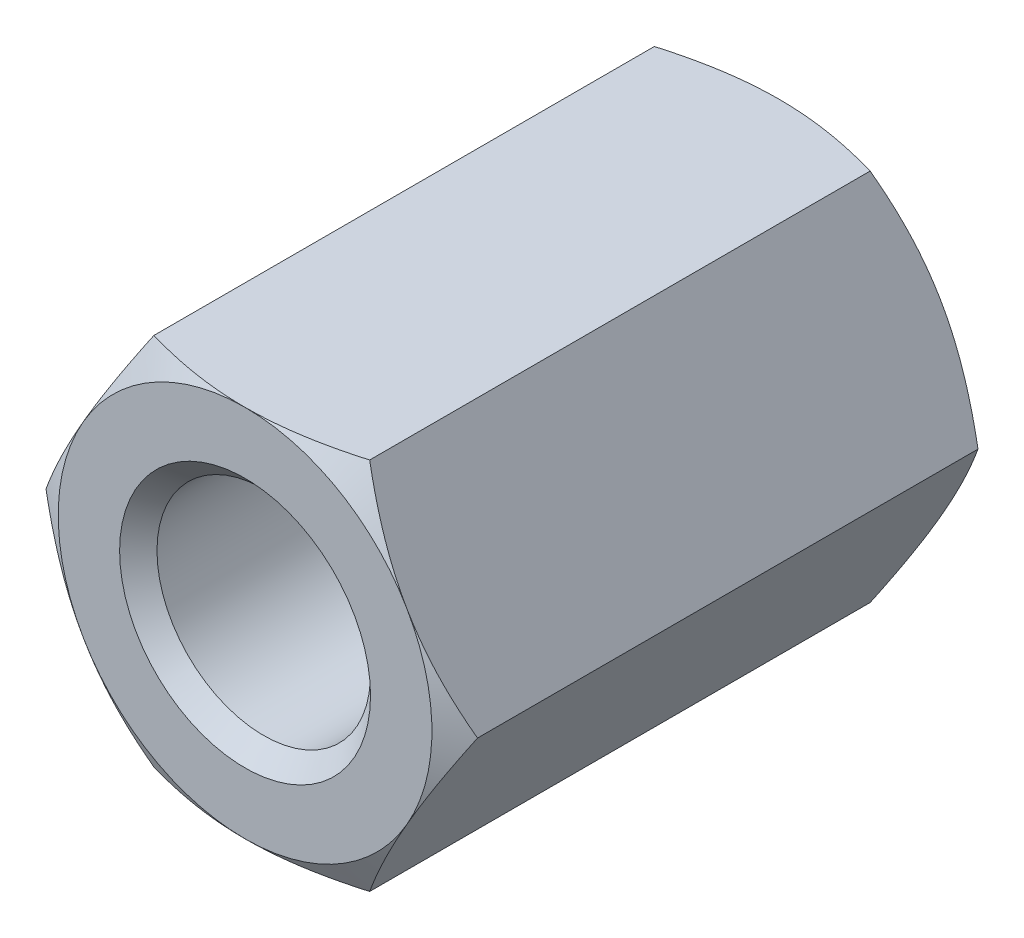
ISO-10303-21;
HEADER;
FILE_DESCRIPTION(('STEP AP214'),'2;1');
FILE_NAME('part.step','',(''),(''),'','','');
FILE_SCHEMA(('AUTOMOTIVE_DESIGN { 1 0 10303 214 1 1 1 1 }'));
ENDSEC;
DATA;
#1=APPLICATION_CONTEXT('core data for automotive mechanical design processes');
#2=APPLICATION_PROTOCOL_DEFINITION('international standard','automotive_design',2000,#1);
#3=PRODUCT_CONTEXT('',#1,'mechanical');
#4=PRODUCT('Part','Part','',(#3));
#5=PRODUCT_RELATED_PRODUCT_CATEGORY('part','',(#4));
#6=PRODUCT_DEFINITION_FORMATION('','',#4);
#7=PRODUCT_DEFINITION_CONTEXT('part definition',#1,'design');
#8=PRODUCT_DEFINITION('design','',#6,#7);
#9=PRODUCT_DEFINITION_SHAPE('','',#8);
#10=(LENGTH_UNIT() NAMED_UNIT(*) SI_UNIT(.MILLI.,.METRE.));
#11=(NAMED_UNIT(*) PLANE_ANGLE_UNIT() SI_UNIT($,.RADIAN.));
#12=(NAMED_UNIT(*) SI_UNIT($,.STERADIAN.) SOLID_ANGLE_UNIT());
#13=UNCERTAINTY_MEASURE_WITH_UNIT(LENGTH_MEASURE(1.E-05),#10,'distance_accuracy_value','');
#14=(GEOMETRIC_REPRESENTATION_CONTEXT(3) GLOBAL_UNCERTAINTY_ASSIGNED_CONTEXT((#13)) GLOBAL_UNIT_ASSIGNED_CONTEXT((#10,
#11,#12)) REPRESENTATION_CONTEXT('',''));
#15=CARTESIAN_POINT('',(0.,0.,0.));
#16=DIRECTION('',(0.,0.,1.));
#17=DIRECTION('',(1.,0.,0.));
#18=AXIS2_PLACEMENT_3D('',#15,#16,#17);
#19=CARTESIAN_POINT('',(4.04145188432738,0.,-5.));
#20=DIRECTION('',(0.866025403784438,0.5,0.));
#21=DIRECTION('',(-0.5,0.866025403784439,0.));
#22=AXIS2_PLACEMENT_3D('',#19,#20,#21);
#23=PLANE('',#22);
#24=CARTESIAN_POINT('',(4.04156735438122,-0.00019999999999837,4.68732593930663));
#25=CARTESIAN_POINT('',(3.9527667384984,0.153607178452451,4.73861421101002));
#26=CARTESIAN_POINT('',(3.86319960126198,0.308742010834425,4.7852590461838));
#27=CARTESIAN_POINT('',(3.68251437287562,0.621698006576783,4.86667812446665));
#28=CARTESIAN_POINT('',(3.59139307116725,0.779524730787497,4.90142356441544));
#29=CARTESIAN_POINT('',(3.41027974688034,1.09322221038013,4.95550997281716));
#30=CARTESIAN_POINT('',(3.32031559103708,1.24904469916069,4.97521091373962));
#31=CARTESIAN_POINT('',(3.13996396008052,1.56142288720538,4.99872986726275));
#32=CARTESIAN_POINT('',(3.04957714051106,1.71797745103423,5.00256735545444));
#33=CARTESIAN_POINT('',(2.88068384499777,2.01050921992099,4.99458469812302));
#34=CARTESIAN_POINT('',(2.80215208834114,2.14653021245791,4.98472456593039));
#35=CARTESIAN_POINT('',(2.64560020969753,2.417686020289,4.9534735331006));
#36=CARTESIAN_POINT('',(2.5675806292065,2.55281989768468,4.9320719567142));
#37=CARTESIAN_POINT('',(2.41070596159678,2.82453479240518,4.87856959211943));
#38=CARTESIAN_POINT('',(2.33187072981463,2.96108141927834,4.84624200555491));
#39=CARTESIAN_POINT('',(2.17537608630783,3.2321380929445,4.77287106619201));
#40=CARTESIAN_POINT('',(2.09771466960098,3.36665161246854,4.73184495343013));
#41=CARTESIAN_POINT('',(2.02061047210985,3.5002,4.68732593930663));
#42=B_SPLINE_CURVE_WITH_KNOTS('',3,(#24,#25,#26,#27,#28,#29,#30,#31,#32,#33,#34,#35,#36,#37,#38,
#39,#40,#41),.UNSPECIFIED.,.F.,.F.,(4,2,2,2,2,2,2,2,4),(0.,0.554793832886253,1.11092123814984,
1.65328467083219,2.19498204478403,2.6666513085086,3.13875761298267,3.6213361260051,
4.10296698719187),.UNSPECIFIED.);
#43=CARTESIAN_POINT('',(4.04145188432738,0.,4.68739260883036));
#44=VERTEX_POINT('',#43);
#45=CARTESIAN_POINT('',(3.03108891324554,1.75,5.));
#46=VERTEX_POINT('',#45);
#47=EDGE_CURVE('E127',#44,#46,#42,.T.);
#48=ORIENTED_EDGE('',*,*,#47,.F.);
#49=DIRECTION('',(0.,0.,1.));
#50=VECTOR('',#49,1.);
#51=CARTESIAN_POINT('',(4.04145188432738,0.,-5.));
#52=LINE('',#51,#50);
#53=CARTESIAN_POINT('',(4.04145188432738,0.,-4.68739260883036));
#54=VERTEX_POINT('',#53);
#55=EDGE_CURVE('E526',#54,#44,#52,.T.);
#56=ORIENTED_EDGE('',*,*,#55,.F.);
#57=CARTESIAN_POINT('',(4.04156735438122,-0.00019999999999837,-4.68732593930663));
#58=CARTESIAN_POINT('',(3.9527667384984,0.153607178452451,-4.73861421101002));
#59=CARTESIAN_POINT('',(3.86319960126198,0.308742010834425,-4.7852590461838));
#60=CARTESIAN_POINT('',(3.68251437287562,0.621698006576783,-4.86667812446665));
#61=CARTESIAN_POINT('',(3.59139307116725,0.779524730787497,-4.90142356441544));
#62=CARTESIAN_POINT('',(3.41027974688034,1.09322221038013,-4.95550997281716));
#63=CARTESIAN_POINT('',(3.32031559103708,1.24904469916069,-4.97521091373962));
#64=CARTESIAN_POINT('',(3.13996396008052,1.56142288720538,-4.99872986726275));
#65=CARTESIAN_POINT('',(3.04957714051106,1.71797745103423,-5.00256735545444));
#66=CARTESIAN_POINT('',(2.88068384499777,2.01050921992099,-4.99458469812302));
#67=CARTESIAN_POINT('',(2.80215208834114,2.14653021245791,-4.98472456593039));
#68=CARTESIAN_POINT('',(2.64560020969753,2.417686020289,-4.9534735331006));
#69=CARTESIAN_POINT('',(2.5675806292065,2.55281989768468,-4.9320719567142));
#70=CARTESIAN_POINT('',(2.41070596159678,2.82453479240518,-4.87856959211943));
#71=CARTESIAN_POINT('',(2.33187072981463,2.96108141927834,-4.84624200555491));
#72=CARTESIAN_POINT('',(2.17537608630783,3.2321380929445,-4.77287106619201));
#73=CARTESIAN_POINT('',(2.09771466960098,3.36665161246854,-4.73184495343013));
#74=CARTESIAN_POINT('',(2.02061047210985,3.5002,-4.68732593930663));
#75=B_SPLINE_CURVE_WITH_KNOTS('',3,(#57,#58,#59,#60,#61,#62,#63,#64,#65,#66,#67,#68,#69,#70,#71,
#72,#73,#74),.UNSPECIFIED.,.F.,.F.,(4,2,2,2,2,2,2,2,4),(0.,0.554793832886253,1.11092123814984,
1.65328467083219,2.19498204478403,2.6666513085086,3.13875761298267,3.6213361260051,
4.10296698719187),.UNSPECIFIED.);
#76=CARTESIAN_POINT('',(3.03108891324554,1.75,-5.));
#77=VERTEX_POINT('',#76);
#78=EDGE_CURVE('E618',#54,#77,#75,.T.);
#79=ORIENTED_EDGE('',*,*,#78,.T.);
#80=CARTESIAN_POINT('',(2.02072594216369,3.5,-4.68739260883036));
#81=VERTEX_POINT('',#80);
#82=EDGE_CURVE('E268',#77,#81,#75,.T.);
#83=ORIENTED_EDGE('',*,*,#82,.T.);
#84=DIRECTION('',(0.,0.,1.));
#85=VECTOR('',#84,1.);
#86=CARTESIAN_POINT('',(2.02072594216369,3.5,-5.));
#87=LINE('',#86,#85);
#88=CARTESIAN_POINT('',(2.0207259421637,3.5,4.68739260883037));
#89=VERTEX_POINT('',#88);
#90=EDGE_CURVE('E159',#81,#89,#87,.T.);
#91=ORIENTED_EDGE('',*,*,#90,.T.);
#92=EDGE_CURVE('E140',#46,#89,#42,.T.);
#93=ORIENTED_EDGE('',*,*,#92,.F.);
#94=EDGE_LOOP('',(#48,#56,#79,#83,#91,#93));
#95=FACE_BOUND('',#94,.T.);
#96=ADVANCED_FACE('F41',(#95),#23,.T.);
#97=CARTESIAN_POINT('',(2.02072594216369,-3.5,-5.));
#98=DIRECTION('',(0.866025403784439,-0.5,0.));
#99=DIRECTION('',(0.5,0.866025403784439,0.));
#100=AXIS2_PLACEMENT_3D('',#97,#98,#99);
#101=PLANE('',#100);
#102=CARTESIAN_POINT('',(2.02061047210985,-3.5002,4.68732593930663));
#103=CARTESIAN_POINT('',(2.10941108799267,-3.34639282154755,4.73861421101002));
#104=CARTESIAN_POINT('',(2.19897822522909,-3.19125798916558,4.7852590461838));
#105=CARTESIAN_POINT('',(2.37966345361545,-2.87830199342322,4.86667812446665));
#106=CARTESIAN_POINT('',(2.47078475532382,-2.7204752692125,4.90142356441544));
#107=CARTESIAN_POINT('',(2.65189807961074,-2.40677778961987,4.95550997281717));
#108=CARTESIAN_POINT('',(2.74186223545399,-2.25095530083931,4.97521091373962));
#109=CARTESIAN_POINT('',(2.92221386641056,-1.93857711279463,4.99872986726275));
#110=CARTESIAN_POINT('',(3.01260068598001,-1.78202254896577,5.00256735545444));
#111=CARTESIAN_POINT('',(3.1814939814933,-1.48949078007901,4.99458469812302));
#112=CARTESIAN_POINT('',(3.26002573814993,-1.35346978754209,4.98472456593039));
#113=CARTESIAN_POINT('',(3.41657761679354,-1.082313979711,4.9534735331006));
#114=CARTESIAN_POINT('',(3.49459719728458,-0.947180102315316,4.9320719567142));
#115=CARTESIAN_POINT('',(3.65147186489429,-0.675465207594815,4.87856959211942));
#116=CARTESIAN_POINT('',(3.73030709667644,-0.538918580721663,4.84624200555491));
#117=CARTESIAN_POINT('',(3.88680174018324,-0.267861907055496,4.77287106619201));
#118=CARTESIAN_POINT('',(3.96446315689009,-0.133348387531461,4.73184495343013));
#119=CARTESIAN_POINT('',(4.04156735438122,0.000200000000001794,4.68732593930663));
#120=B_SPLINE_CURVE_WITH_KNOTS('',3,(#102,#103,#104,#105,#106,#107,#108,#109,#110,#111,#112,
#113,#114,#115,#116,#117,#118,#119),.UNSPECIFIED.,.F.,.F.,(4,2,2,2,2,2,2,2,4),(0.,
0.554793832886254,1.11092123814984,1.65328467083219,2.19498204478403,2.6666513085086,
3.13875761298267,3.6213361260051,4.10296698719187),.UNSPECIFIED.);
#121=CARTESIAN_POINT('',(2.02072594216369,-3.5,4.68739260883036));
#122=VERTEX_POINT('',#121);
#123=CARTESIAN_POINT('',(3.03108891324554,-1.75,5.));
#124=VERTEX_POINT('',#123);
#125=EDGE_CURVE('E559',#122,#124,#120,.T.);
#126=ORIENTED_EDGE('',*,*,#125,.F.);
#127=DIRECTION('',(0.,0.,1.));
#128=VECTOR('',#127,1.);
#129=CARTESIAN_POINT('',(2.02072594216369,-3.5,-5.));
#130=LINE('',#129,#128);
#131=CARTESIAN_POINT('',(2.02072594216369,-3.5,-4.68739260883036));
#132=VERTEX_POINT('',#131);
#133=EDGE_CURVE('E282',#132,#122,#130,.T.);
#134=ORIENTED_EDGE('',*,*,#133,.F.);
#135=CARTESIAN_POINT('',(2.02061047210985,-3.5002,-4.68732593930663));
#136=CARTESIAN_POINT('',(2.10941108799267,-3.34639282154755,-4.73861421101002));
#137=CARTESIAN_POINT('',(2.19897822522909,-3.19125798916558,-4.7852590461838));
#138=CARTESIAN_POINT('',(2.37966345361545,-2.87830199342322,-4.86667812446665));
#139=CARTESIAN_POINT('',(2.47078475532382,-2.7204752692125,-4.90142356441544));
#140=CARTESIAN_POINT('',(2.65189807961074,-2.40677778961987,-4.95550997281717));
#141=CARTESIAN_POINT('',(2.74186223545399,-2.25095530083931,-4.97521091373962));
#142=CARTESIAN_POINT('',(2.92221386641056,-1.93857711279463,-4.99872986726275));
#143=CARTESIAN_POINT('',(3.01260068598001,-1.78202254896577,-5.00256735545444));
#144=CARTESIAN_POINT('',(3.1814939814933,-1.48949078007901,-4.99458469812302));
#145=CARTESIAN_POINT('',(3.26002573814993,-1.35346978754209,-4.98472456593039));
#146=CARTESIAN_POINT('',(3.41657761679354,-1.082313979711,-4.9534735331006));
#147=CARTESIAN_POINT('',(3.49459719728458,-0.947180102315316,-4.9320719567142));
#148=CARTESIAN_POINT('',(3.65147186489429,-0.675465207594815,-4.87856959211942));
#149=CARTESIAN_POINT('',(3.73030709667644,-0.538918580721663,-4.84624200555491));
#150=CARTESIAN_POINT('',(3.88680174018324,-0.267861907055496,-4.77287106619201));
#151=CARTESIAN_POINT('',(3.96446315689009,-0.133348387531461,-4.73184495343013));
#152=CARTESIAN_POINT('',(4.04156735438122,0.000200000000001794,-4.68732593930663));
#153=B_SPLINE_CURVE_WITH_KNOTS('',3,(#135,#136,#137,#138,#139,#140,#141,#142,#143,#144,#145,
#146,#147,#148,#149,#150,#151,#152),.UNSPECIFIED.,.F.,.F.,(4,2,2,2,2,2,2,2,4),(0.,
0.554793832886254,1.11092123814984,1.65328467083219,2.19498204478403,2.6666513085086,
3.13875761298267,3.6213361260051,4.10296698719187),.UNSPECIFIED.);
#154=CARTESIAN_POINT('',(3.03108891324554,-1.75,-5.));
#155=VERTEX_POINT('',#154);
#156=EDGE_CURVE('E588',#132,#155,#153,.T.);
#157=ORIENTED_EDGE('',*,*,#156,.T.);
#158=EDGE_CURVE('E283',#155,#54,#153,.T.);
#159=ORIENTED_EDGE('',*,*,#158,.T.);
#160=ORIENTED_EDGE('',*,*,#55,.T.);
#161=EDGE_CURVE('E132',#124,#44,#120,.T.);
#162=ORIENTED_EDGE('',*,*,#161,.F.);
#163=EDGE_LOOP('',(#126,#134,#157,#159,#160,#162));
#164=FACE_BOUND('',#163,.T.);
#165=ADVANCED_FACE('F253',(#164),#101,.T.);
#166=CARTESIAN_POINT('',(-2.02072594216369,-3.5,-5.));
#167=DIRECTION('',(0.,-1.,0.));
#168=DIRECTION('',(1.,0.,0.));
#169=AXIS2_PLACEMENT_3D('',#166,#167,#168);
#170=PLANE('',#169);
#171=CARTESIAN_POINT('',(-10.7507738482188,-3.5,0.493114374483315));
#172=CARTESIAN_POINT('',(-10.5126698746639,-3.5,0.623821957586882));
#173=CARTESIAN_POINT('',(-10.2743971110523,-3.5,0.754223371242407));
#174=CARTESIAN_POINT('',(-9.79742424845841,-3.5,1.0142498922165));
#175=CARTESIAN_POINT('',(-9.55872414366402,-3.5,1.1438749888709));
#176=CARTESIAN_POINT('',(-9.08067833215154,-3.5,1.40225430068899));
#177=CARTESIAN_POINT('',(-8.84133233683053,-3.5,1.53100798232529));
#178=CARTESIAN_POINT('',(-8.36201160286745,-3.5,1.78733734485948));
#179=CARTESIAN_POINT('',(-8.12203686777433,-3.5,1.9149130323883));
#180=CARTESIAN_POINT('',(-7.6360811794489,-3.5,2.17133452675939));
#181=CARTESIAN_POINT('',(-7.39008299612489,-3.5,2.30014772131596));
#182=CARTESIAN_POINT('',(-6.89704804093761,-3.5,2.55577000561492));
#183=CARTESIAN_POINT('',(-6.65001127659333,-3.5,2.68257910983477));
#184=CARTESIAN_POINT('',(-6.15465612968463,-3.5,2.93352397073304));
#185=CARTESIAN_POINT('',(-5.90633807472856,-3.5,3.05766037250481));
#186=CARTESIAN_POINT('',(-5.40795190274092,-3.5,3.30236027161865));
#187=CARTESIAN_POINT('',(-5.15788384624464,-3.5,3.42292389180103));
#188=CARTESIAN_POINT('',(-4.64929297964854,-3.5,3.66197947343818));
#189=CARTESIAN_POINT('',(-4.39071255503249,-3.5,3.78034953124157));
#190=CARTESIAN_POINT('',(-3.87015745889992,-3.5,4.00964989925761));
#191=CARTESIAN_POINT('',(-3.60818190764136,-3.5,4.12057823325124));
#192=CARTESIAN_POINT('',(-3.08089609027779,-3.5,4.33088961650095));
#193=CARTESIAN_POINT('',(-2.81560515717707,-3.5,4.43032054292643));
#194=CARTESIAN_POINT('',(-2.27929281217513,-3.5,4.61253202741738));
#195=CARTESIAN_POINT('',(-2.00827391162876,-3.5,4.69531972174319));
#196=CARTESIAN_POINT('',(-1.54282289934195,-3.5,4.81459034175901));
#197=CARTESIAN_POINT('',(-1.35006631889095,-3.5,4.85750298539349));
#198=CARTESIAN_POINT('',(-0.961730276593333,-3.5,4.92780027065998));
#199=CARTESIAN_POINT('',(-0.766151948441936,-3.5,4.95519097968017));
#200=CARTESIAN_POINT('',(-0.374300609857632,-3.5,4.99152322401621));
#201=CARTESIAN_POINT('',(-0.178037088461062,-3.5,5.00056381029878));
#202=CARTESIAN_POINT('',(0.214451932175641,-3.5,4.99938150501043));
#203=CARTESIAN_POINT('',(0.410677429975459,-3.5,4.98915798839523));
#204=CARTESIAN_POINT('',(0.733992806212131,-3.5,4.9573376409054));
#205=CARTESIAN_POINT('',(0.861622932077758,-3.5,4.94086914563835));
#206=CARTESIAN_POINT('',(1.1157982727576,-3.5,4.90097185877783));
#207=CARTESIAN_POINT('',(1.24234333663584,-3.5,4.87754211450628));
#208=CARTESIAN_POINT('',(1.62024456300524,-3.5,4.79811364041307));
#209=CARTESIAN_POINT('',(1.86969580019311,-3.5,4.73299473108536));
#210=CARTESIAN_POINT('',(2.24231826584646,-3.5,4.62166992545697));
#211=CARTESIAN_POINT('',(2.36750184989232,-3.5,4.58182091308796));
#212=CARTESIAN_POINT('',(2.61663244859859,-3.5,4.49839474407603));
#213=CARTESIAN_POINT('',(2.74057945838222,-3.5,4.4548175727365));
#214=CARTESIAN_POINT('',(2.98728700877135,-3.5,4.36461508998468));
#215=CARTESIAN_POINT('',(3.1100480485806,-3.5,4.31799113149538));
#216=CARTESIAN_POINT('',(3.35457324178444,-3.5,4.2222085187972));
#217=CARTESIAN_POINT('',(3.47633740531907,-3.5,4.1730498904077));
#218=CARTESIAN_POINT('',(3.75851776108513,-3.5,4.05627784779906));
#219=CARTESIAN_POINT('',(3.91860417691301,-3.5,3.9878691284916));
#220=CARTESIAN_POINT('',(4.23750900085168,-3.5,3.84815013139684));
#221=CARTESIAN_POINT('',(4.39632734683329,-3.5,3.77683971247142));
#222=CARTESIAN_POINT('',(4.71293162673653,-3.5,3.63190033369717));
#223=CARTESIAN_POINT('',(4.87071738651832,-3.5,3.55827099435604));
#224=CARTESIAN_POINT('',(5.18540844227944,-3.5,3.40915170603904));
#225=CARTESIAN_POINT('',(5.34231372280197,-3.5,3.33366172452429));
#226=CARTESIAN_POINT('',(5.81219833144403,-3.5,3.10481067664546));
#227=CARTESIAN_POINT('',(6.12407798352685,-3.5,2.94919293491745));
#228=CARTESIAN_POINT('',(6.74576517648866,-3.5,2.6338733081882));
#229=CARTESIAN_POINT('',(7.05557265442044,-3.5,2.47417129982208));
#230=CARTESIAN_POINT('',(7.64897162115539,-3.5,2.16473651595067));
#231=CARTESIAN_POINT('',(7.9326796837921,-3.5,2.01522691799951));
#232=CARTESIAN_POINT('',(8.49912029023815,-3.5,1.71435396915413));
#233=CARTESIAN_POINT('',(8.78185280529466,-3.5,1.56299056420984));
#234=CARTESIAN_POINT('',(9.34596523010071,-3.5,1.2591656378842));
#235=CARTESIAN_POINT('',(9.62734673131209,-3.5,1.10670706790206));
#236=CARTESIAN_POINT('',(10.1894867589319,-3.5,0.800675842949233));
#237=CARTESIAN_POINT('',(10.4702453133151,-3.5,0.64710323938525));
#238=CARTESIAN_POINT('',(10.7507738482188,-3.5,0.493114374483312));
#239=B_SPLINE_CURVE_WITH_KNOTS('',3,(#171,#172,#173,#174,#175,#176,#177,#178,#179,#180,#181,
#182,#183,#184,#185,#186,#187,#188,#189,#190,#191,#192,#193,#194,#195,#196,#197,#198,#199,#200,
#201,#202,#203,#204,#205,#206,#207,#208,#209,#210,#211,#212,#213,#214,#215,#216,#217,#218,#219,
#220,#221,#222,#223,#224,#225,#226,#227,#228,#229,#230,#231,#232,#233,#234,#235,#236,#237,#238),
.UNSPECIFIED.,.F.,.F.,(4,2,2,2,2,2,2,2,2,2,2,2,2,2,2,2,2,2,2,2,2,2,2,2,2,2,2,2,2,2,2,2,2,4),(0.,
0.814863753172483,1.62973867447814,2.44507408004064,3.26040489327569,4.09344743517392,
4.92648395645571,5.75931710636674,6.59212158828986,7.44520212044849,8.2985083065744,
9.14812242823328,9.99737147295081,10.5893043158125,11.1810056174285,11.7695044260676,
12.3580223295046,12.7438949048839,13.1298203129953,13.9021847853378,14.2962763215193,
14.6903694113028,15.0842886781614,15.478203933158,16.0004361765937,16.5226938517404,
17.0450374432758,17.5673901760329,18.6129831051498,19.6586076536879,20.6206746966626,
21.5827698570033,22.5428569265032,23.5028999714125),.UNSPECIFIED.);
#240=CARTESIAN_POINT('',(-2.02072594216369,-3.5,4.68739260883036));
#241=VERTEX_POINT('',#240);
#242=CARTESIAN_POINT('',(0.,-3.5,5.));
#243=VERTEX_POINT('',#242);
#244=EDGE_CURVE('E552',#241,#243,#239,.T.);
#245=ORIENTED_EDGE('',*,*,#244,.F.);
#246=DIRECTION('',(0.,0.,1.));
#247=VECTOR('',#246,1.);
#248=CARTESIAN_POINT('',(-2.02072594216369,-3.5,-5.));
#249=LINE('',#248,#247);
#250=CARTESIAN_POINT('',(-2.02072594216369,-3.5,-4.68739260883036));
#251=VERTEX_POINT('',#250);
#252=EDGE_CURVE('E577',#251,#241,#249,.T.);
#253=ORIENTED_EDGE('',*,*,#252,.F.);
#254=CARTESIAN_POINT('',(-7.9267982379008,-3.5,-2.01792238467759));
#255=CARTESIAN_POINT('',(-7.74585500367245,-3.5,-2.11347826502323));
#256=CARTESIAN_POINT('',(-7.56469853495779,-3.5,-2.20863320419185));
#257=CARTESIAN_POINT('',(-7.20185417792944,-3.5,-2.39793519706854));
#258=CARTESIAN_POINT('',(-7.02016627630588,-3.5,-2.49208222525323));
#259=CARTESIAN_POINT('',(-6.65593697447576,-3.5,-2.67927382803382));
#260=CARTESIAN_POINT('',(-6.47339479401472,-3.5,-2.77231688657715));
#261=CARTESIAN_POINT('',(-6.1075482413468,-3.5,-2.95689246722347));
#262=CARTESIAN_POINT('',(-5.9242438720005,-3.5,-3.04842499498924));
#263=CARTESIAN_POINT('',(-5.54664352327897,-3.5,-3.23456421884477));
#264=CARTESIAN_POINT('',(-5.35229516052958,-3.5,-3.32906489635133));
#265=CARTESIAN_POINT('',(-4.96230623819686,-3.5,-3.51537367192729));
#266=CARTESIAN_POINT('',(-4.76666566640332,-3.5,-3.60718174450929));
#267=CARTESIAN_POINT('',(-4.37385366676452,-3.5,-3.78723837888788));
#268=CARTESIAN_POINT('',(-4.17668297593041,-3.5,-3.87548854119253));
#269=CARTESIAN_POINT('',(-3.78031667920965,-3.5,-4.04730762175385));
#270=CARTESIAN_POINT('',(-3.58112119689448,-3.5,-4.13087682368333));
#271=CARTESIAN_POINT('',(-3.16157019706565,-3.5,-4.29916704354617));
#272=CARTESIAN_POINT('',(-2.94096601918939,-3.5,-4.38327567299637));
#273=CARTESIAN_POINT('',(-2.49588109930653,-3.5,-4.54090784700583));
#274=CARTESIAN_POINT('',(-2.27139918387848,-3.5,-4.61442812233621));
#275=CARTESIAN_POINT('',(-1.82231733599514,-3.5,-4.74519733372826));
#276=CARTESIAN_POINT('',(-1.59780434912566,-3.5,-4.80273452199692));
#277=CARTESIAN_POINT('',(-1.25802721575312,-3.5,-4.87429241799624));
#278=CARTESIAN_POINT('',(-1.14430805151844,-3.5,-4.89568205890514));
#279=CARTESIAN_POINT('',(-0.915972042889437,-3.5,-4.9329024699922));
#280=CARTESIAN_POINT('',(-0.801355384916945,-3.5,-4.94873436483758));
#281=CARTESIAN_POINT('',(-0.587977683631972,-3.5,-4.97244310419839));
#282=CARTESIAN_POINT('',(-0.489307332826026,-3.5,-4.98113663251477));
#283=CARTESIAN_POINT('',(-0.291673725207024,-3.5,-4.99378801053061));
#284=CARTESIAN_POINT('',(-0.192710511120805,-3.5,-4.9977465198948));
#285=CARTESIAN_POINT('',(0.00527862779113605,-3.5,-5.00080497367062));
#286=CARTESIAN_POINT('',(0.104304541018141,-3.5,-4.99990564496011));
#287=CARTESIAN_POINT('',(0.302186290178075,-3.5,-4.99328592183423));
#288=CARTESIAN_POINT('',(0.401042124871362,-3.5,-4.98756549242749));
#289=CARTESIAN_POINT('',(0.700661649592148,-3.5,-4.96309822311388));
#290=CARTESIAN_POINT('',(0.900867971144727,-3.5,-4.93699536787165));
#291=CARTESIAN_POINT('',(1.19891955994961,-3.5,-4.88544014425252));
#292=CARTESIAN_POINT('',(1.2979194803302,-3.5,-4.86618155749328));
#293=CARTESIAN_POINT('',(1.49513477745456,-3.5,-4.82398116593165));
#294=CARTESIAN_POINT('',(1.59335017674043,-3.5,-4.80103946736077));
#295=CARTESIAN_POINT('',(1.83374956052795,-3.5,-4.74065787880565));
#296=CARTESIAN_POINT('',(1.97547261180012,-3.5,-4.70138966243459));
#297=CARTESIAN_POINT('',(2.25723868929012,-3.5,-4.61721544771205));
#298=CARTESIAN_POINT('',(2.39728144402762,-3.5,-4.57230855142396));
#299=CARTESIAN_POINT('',(2.67593858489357,-3.5,-4.47789895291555));
#300=CARTESIAN_POINT('',(2.81455158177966,-3.5,-4.42839217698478));
#301=CARTESIAN_POINT('',(3.09039174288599,-3.5,-4.3257051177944));
#302=CARTESIAN_POINT('',(3.22761899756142,-3.5,-4.2725250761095));
#303=CARTESIAN_POINT('',(3.50148947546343,-3.5,-4.16295081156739));
#304=CARTESIAN_POINT('',(3.63812736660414,-3.5,-4.10654331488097));
#305=CARTESIAN_POINT('',(3.91037121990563,-3.5,-3.99128927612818));
#306=CARTESIAN_POINT('',(4.04597715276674,-3.5,-3.93244266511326));
#307=CARTESIAN_POINT('',(4.45134783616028,-3.5,-3.75299211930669));
#308=CARTESIAN_POINT('',(4.71979905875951,-3.5,-3.6294229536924));
#309=CARTESIAN_POINT('',(5.23640668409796,-3.5,-3.3852726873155));
#310=CARTESIAN_POINT('',(5.48472802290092,-3.5,-3.26503715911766));
#311=CARTESIAN_POINT('',(5.97971131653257,-3.5,-3.02112901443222));
#312=CARTESIAN_POINT('',(6.22637306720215,-3.5,-2.89745598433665));
#313=CARTESIAN_POINT('',(6.71590281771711,-3.5,-2.64885013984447));
#314=CARTESIAN_POINT('',(6.95878387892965,-3.5,-2.52394295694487));
#315=CARTESIAN_POINT('',(7.44349847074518,-3.5,-2.27222658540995));
#316=CARTESIAN_POINT('',(7.68533219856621,-3.5,-2.14541777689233));
#317=CARTESIAN_POINT('',(7.9267982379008,-3.5,-2.01792238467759));
#318=B_SPLINE_CURVE_WITH_KNOTS('',3,(#254,#255,#256,#257,#258,#259,#260,#261,#262,#263,#264,
#265,#266,#267,#268,#269,#270,#271,#272,#273,#274,#275,#276,#277,#278,#279,#280,#281,#282,#283,
#284,#285,#286,#287,#288,#289,#290,#291,#292,#293,#294,#295,#296,#297,#298,#299,#300,#301,#302,
#303,#304,#305,#306,#307,#308,#309,#310,#311,#312,#313,#314,#315,#316,#317),.UNSPECIFIED.,.F.,
.F.,(4,2,2,2,2,2,2,2,2,2,2,2,2,2,2,2,2,2,2,2,2,2,2,2,2,2,2,2,2,2,2,4),(0.,0.613876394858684,
1.22776829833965,1.84242338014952,2.45707615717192,3.10537717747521,3.75368433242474,
4.40169651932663,5.04966939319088,5.75775575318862,6.46606027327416,7.16061004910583,
7.50763711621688,7.85459391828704,8.15164543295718,8.44865555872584,8.74562124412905,
9.04258908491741,9.64730887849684,9.94982773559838,10.2523378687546,10.6933745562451,
11.1344815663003,11.5759830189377,12.0174554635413,12.4608962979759,12.9043496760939,
13.790823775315,14.6184909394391,15.4462581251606,16.2656007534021,17.0847817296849),.UNSPECIFIED.);
#319=CARTESIAN_POINT('',(0.,-3.5,-5.));
#320=VERTEX_POINT('',#319);
#321=EDGE_CURVE('E575',#251,#320,#318,.T.);
#322=ORIENTED_EDGE('',*,*,#321,.T.);
#323=EDGE_CURVE('E258',#320,#132,#318,.T.);
#324=ORIENTED_EDGE('',*,*,#323,.T.);
#325=ORIENTED_EDGE('',*,*,#133,.T.);
#326=EDGE_CURVE('E138',#243,#122,#239,.T.);
#327=ORIENTED_EDGE('',*,*,#326,.F.);
#328=EDGE_LOOP('',(#245,#253,#322,#324,#325,#327));
#329=FACE_BOUND('',#328,.T.);
#330=ADVANCED_FACE('F291',(#329),#170,.T.);
#331=CARTESIAN_POINT('',(-4.04145188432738,0.,-5.));
#332=DIRECTION('',(-0.866025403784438,-0.5,0.));
#333=DIRECTION('',(0.5,-0.866025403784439,0.));
#334=AXIS2_PLACEMENT_3D('',#331,#332,#333);
#335=PLANE('',#334);
#336=CARTESIAN_POINT('',(-4.04156735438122,0.000199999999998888,4.68732593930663));
#337=CARTESIAN_POINT('',(-3.9527667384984,-0.153607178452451,4.73861421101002));
#338=CARTESIAN_POINT('',(-3.86319960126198,-0.308742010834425,4.78525904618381));
#339=CARTESIAN_POINT('',(-3.68251437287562,-0.621698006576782,4.86667812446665));
#340=CARTESIAN_POINT('',(-3.59139307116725,-0.779524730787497,4.90142356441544));
#341=CARTESIAN_POINT('',(-3.41027974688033,-1.09322221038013,4.95550997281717));
#342=CARTESIAN_POINT('',(-3.32031559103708,-1.24904469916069,4.97521091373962));
#343=CARTESIAN_POINT('',(-3.13996396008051,-1.56142288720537,4.99872986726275));
#344=CARTESIAN_POINT('',(-3.04957714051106,-1.71797745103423,5.00256735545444));
#345=CARTESIAN_POINT('',(-2.88068384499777,-2.01050921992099,4.99458469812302));
#346=CARTESIAN_POINT('',(-2.80215208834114,-2.14653021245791,4.98472456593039));
#347=CARTESIAN_POINT('',(-2.64560020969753,-2.41768602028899,4.9534735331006));
#348=CARTESIAN_POINT('',(-2.56758062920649,-2.55281989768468,4.9320719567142));
#349=CARTESIAN_POINT('',(-2.41070596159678,-2.82453479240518,4.87856959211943));
#350=CARTESIAN_POINT('',(-2.33187072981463,-2.96108141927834,4.84624200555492));
#351=CARTESIAN_POINT('',(-2.17537608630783,-3.2321380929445,4.77287106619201));
#352=CARTESIAN_POINT('',(-2.09771466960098,-3.36665161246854,4.73184495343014));
#353=CARTESIAN_POINT('',(-2.02061047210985,-3.5002,4.68732593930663));
#354=B_SPLINE_CURVE_WITH_KNOTS('',3,(#336,#337,#338,#339,#340,#341,#342,#343,#344,#345,#346,
#347,#348,#349,#350,#351,#352,#353),.UNSPECIFIED.,.F.,.F.,(4,2,2,2,2,2,2,2,4),(0.,
0.554793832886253,1.11092123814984,1.65328467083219,2.19498204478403,2.6666513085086,
3.13875761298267,3.6213361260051,4.10296698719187),.UNSPECIFIED.);
#355=CARTESIAN_POINT('',(-4.04145188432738,0.,4.68739260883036));
#356=VERTEX_POINT('',#355);
#357=CARTESIAN_POINT('',(-3.03108891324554,-1.75,5.));
#358=VERTEX_POINT('',#357);
#359=EDGE_CURVE('E175',#356,#358,#354,.T.);
#360=ORIENTED_EDGE('',*,*,#359,.F.);
#361=DIRECTION('',(0.,0.,1.));
#362=VECTOR('',#361,1.);
#363=CARTESIAN_POINT('',(-4.04145188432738,0.,-5.));
#364=LINE('',#363,#362);
#365=CARTESIAN_POINT('',(-4.04145188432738,0.,-4.68739260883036));
#366=VERTEX_POINT('',#365);
#367=EDGE_CURVE('E581',#366,#356,#364,.T.);
#368=ORIENTED_EDGE('',*,*,#367,.F.);
#369=CARTESIAN_POINT('',(-4.04156735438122,0.000199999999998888,-4.68732593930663));
#370=CARTESIAN_POINT('',(-3.9527667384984,-0.153607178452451,-4.73861421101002));
#371=CARTESIAN_POINT('',(-3.86319960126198,-0.308742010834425,-4.78525904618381));
#372=CARTESIAN_POINT('',(-3.68251437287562,-0.621698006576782,-4.86667812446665));
#373=CARTESIAN_POINT('',(-3.59139307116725,-0.779524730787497,-4.90142356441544));
#374=CARTESIAN_POINT('',(-3.41027974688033,-1.09322221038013,-4.95550997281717));
#375=CARTESIAN_POINT('',(-3.32031559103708,-1.24904469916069,-4.97521091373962));
#376=CARTESIAN_POINT('',(-3.13996396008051,-1.56142288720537,-4.99872986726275));
#377=CARTESIAN_POINT('',(-3.04957714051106,-1.71797745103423,-5.00256735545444));
#378=CARTESIAN_POINT('',(-2.88068384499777,-2.01050921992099,-4.99458469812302));
#379=CARTESIAN_POINT('',(-2.80215208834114,-2.14653021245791,-4.98472456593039));
#380=CARTESIAN_POINT('',(-2.64560020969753,-2.41768602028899,-4.9534735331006));
#381=CARTESIAN_POINT('',(-2.56758062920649,-2.55281989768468,-4.9320719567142));
#382=CARTESIAN_POINT('',(-2.41070596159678,-2.82453479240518,-4.87856959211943));
#383=CARTESIAN_POINT('',(-2.33187072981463,-2.96108141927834,-4.84624200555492));
#384=CARTESIAN_POINT('',(-2.17537608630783,-3.2321380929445,-4.77287106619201));
#385=CARTESIAN_POINT('',(-2.09771466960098,-3.36665161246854,-4.73184495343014));
#386=CARTESIAN_POINT('',(-2.02061047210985,-3.5002,-4.68732593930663));
#387=B_SPLINE_CURVE_WITH_KNOTS('',3,(#369,#370,#371,#372,#373,#374,#375,#376,#377,#378,#379,
#380,#381,#382,#383,#384,#385,#386),.UNSPECIFIED.,.F.,.F.,(4,2,2,2,2,2,2,2,4),(0.,
0.554793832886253,1.11092123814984,1.65328467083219,2.19498204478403,2.6666513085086,
3.13875761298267,3.6213361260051,4.10296698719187),.UNSPECIFIED.);
#388=CARTESIAN_POINT('',(-3.03108891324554,-1.75,-5.));
#389=VERTEX_POINT('',#388);
#390=EDGE_CURVE('E274',#366,#389,#387,.T.);
#391=ORIENTED_EDGE('',*,*,#390,.T.);
#392=EDGE_CURVE('E281',#389,#251,#387,.T.);
#393=ORIENTED_EDGE('',*,*,#392,.T.);
#394=ORIENTED_EDGE('',*,*,#252,.T.);
#395=EDGE_CURVE('E546',#358,#241,#354,.T.);
#396=ORIENTED_EDGE('',*,*,#395,.F.);
#397=EDGE_LOOP('',(#360,#368,#391,#393,#394,#396));
#398=FACE_BOUND('',#397,.T.);
#399=ADVANCED_FACE('F288',(#398),#335,.T.);
#400=CARTESIAN_POINT('',(-2.02072594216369,3.5,-5.));
#401=DIRECTION('',(-0.866025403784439,0.5,0.));
#402=DIRECTION('',(-0.5,-0.866025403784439,0.));
#403=AXIS2_PLACEMENT_3D('',#400,#401,#402);
#404=PLANE('',#403);
#405=CARTESIAN_POINT('',(-2.02061047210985,3.5002,4.68732593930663));
#406=CARTESIAN_POINT('',(-2.10941108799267,3.34639282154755,4.73861421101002));
#407=CARTESIAN_POINT('',(-2.19897822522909,3.19125798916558,4.78525904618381));
#408=CARTESIAN_POINT('',(-2.37966345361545,2.87830199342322,4.86667812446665));
#409=CARTESIAN_POINT('',(-2.47078475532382,2.7204752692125,4.90142356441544));
#410=CARTESIAN_POINT('',(-2.65189807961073,2.40677778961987,4.95550997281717));
#411=CARTESIAN_POINT('',(-2.74186223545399,2.25095530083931,4.97521091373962));
#412=CARTESIAN_POINT('',(-2.92221386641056,1.93857711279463,4.99872986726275));
#413=CARTESIAN_POINT('',(-3.01260068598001,1.78202254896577,5.00256735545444));
#414=CARTESIAN_POINT('',(-3.1814939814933,1.48949078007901,4.99458469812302));
#415=CARTESIAN_POINT('',(-3.26002573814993,1.35346978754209,4.98472456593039));
#416=CARTESIAN_POINT('',(-3.41657761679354,1.082313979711,4.9534735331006));
#417=CARTESIAN_POINT('',(-3.49459719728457,0.947180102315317,4.9320719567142));
#418=CARTESIAN_POINT('',(-3.65147186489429,0.675465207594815,4.87856959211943));
#419=CARTESIAN_POINT('',(-3.73030709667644,0.538918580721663,4.84624200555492));
#420=CARTESIAN_POINT('',(-3.88680174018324,0.267861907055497,4.77287106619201));
#421=CARTESIAN_POINT('',(-3.96446315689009,0.133348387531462,4.73184495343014));
#422=CARTESIAN_POINT('',(-4.04156735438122,-0.000200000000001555,4.68732593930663));
#423=B_SPLINE_CURVE_WITH_KNOTS('',3,(#405,#406,#407,#408,#409,#410,#411,#412,#413,#414,#415,
#416,#417,#418,#419,#420,#421,#422),.UNSPECIFIED.,.F.,.F.,(4,2,2,2,2,2,2,2,4),(0.,
0.554793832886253,1.11092123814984,1.65328467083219,2.19498204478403,2.6666513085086,
3.13875761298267,3.6213361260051,4.10296698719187),.UNSPECIFIED.);
#424=CARTESIAN_POINT('',(-2.02072594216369,3.5,4.68739260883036));
#425=VERTEX_POINT('',#424);
#426=CARTESIAN_POINT('',(-3.03108891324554,1.75,5.));
#427=VERTEX_POINT('',#426);
#428=EDGE_CURVE('E182',#425,#427,#423,.T.);
#429=ORIENTED_EDGE('',*,*,#428,.F.);
#430=DIRECTION('',(0.,0.,1.));
#431=VECTOR('',#430,1.);
#432=CARTESIAN_POINT('',(-2.02072594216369,3.5,-5.));
#433=LINE('',#432,#431);
#434=CARTESIAN_POINT('',(-2.02072594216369,3.5,-4.68739260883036));
#435=VERTEX_POINT('',#434);
#436=EDGE_CURVE('E232',#435,#425,#433,.T.);
#437=ORIENTED_EDGE('',*,*,#436,.F.);
#438=CARTESIAN_POINT('',(-2.02061047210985,3.5002,-4.68732593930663));
#439=CARTESIAN_POINT('',(-2.10941108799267,3.34639282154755,-4.73861421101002));
#440=CARTESIAN_POINT('',(-2.19897822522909,3.19125798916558,-4.78525904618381));
#441=CARTESIAN_POINT('',(-2.37966345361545,2.87830199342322,-4.86667812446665));
#442=CARTESIAN_POINT('',(-2.47078475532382,2.7204752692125,-4.90142356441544));
#443=CARTESIAN_POINT('',(-2.65189807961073,2.40677778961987,-4.95550997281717));
#444=CARTESIAN_POINT('',(-2.74186223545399,2.25095530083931,-4.97521091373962));
#445=CARTESIAN_POINT('',(-2.92221386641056,1.93857711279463,-4.99872986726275));
#446=CARTESIAN_POINT('',(-3.01260068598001,1.78202254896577,-5.00256735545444));
#447=CARTESIAN_POINT('',(-3.1814939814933,1.48949078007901,-4.99458469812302));
#448=CARTESIAN_POINT('',(-3.26002573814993,1.35346978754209,-4.98472456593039));
#449=CARTESIAN_POINT('',(-3.41657761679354,1.082313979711,-4.9534735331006));
#450=CARTESIAN_POINT('',(-3.49459719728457,0.947180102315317,-4.9320719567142));
#451=CARTESIAN_POINT('',(-3.65147186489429,0.675465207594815,-4.87856959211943));
#452=CARTESIAN_POINT('',(-3.73030709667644,0.538918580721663,-4.84624200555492));
#453=CARTESIAN_POINT('',(-3.88680174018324,0.267861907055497,-4.77287106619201));
#454=CARTESIAN_POINT('',(-3.96446315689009,0.133348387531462,-4.73184495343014));
#455=CARTESIAN_POINT('',(-4.04156735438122,-0.000200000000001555,-4.68732593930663));
#456=B_SPLINE_CURVE_WITH_KNOTS('',3,(#438,#439,#440,#441,#442,#443,#444,#445,#446,#447,#448,
#449,#450,#451,#452,#453,#454,#455),.UNSPECIFIED.,.F.,.F.,(4,2,2,2,2,2,2,2,4),(0.,
0.554793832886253,1.11092123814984,1.65328467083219,2.19498204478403,2.6666513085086,
3.13875761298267,3.6213361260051,4.10296698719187),.UNSPECIFIED.);
#457=CARTESIAN_POINT('',(-3.03108891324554,1.75,-5.));
#458=VERTEX_POINT('',#457);
#459=EDGE_CURVE('E236',#435,#458,#456,.T.);
#460=ORIENTED_EDGE('',*,*,#459,.T.);
#461=EDGE_CURVE('E585',#458,#366,#456,.T.);
#462=ORIENTED_EDGE('',*,*,#461,.T.);
#463=ORIENTED_EDGE('',*,*,#367,.T.);
#464=EDGE_CURVE('E534',#427,#356,#423,.T.);
#465=ORIENTED_EDGE('',*,*,#464,.F.);
#466=EDGE_LOOP('',(#429,#437,#460,#462,#463,#465));
#467=FACE_BOUND('',#466,.T.);
#468=ADVANCED_FACE('F217',(#467),#404,.T.);
#469=CARTESIAN_POINT('',(2.02072594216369,3.5,-5.));
#470=DIRECTION('',(0.,1.,0.));
#471=DIRECTION('',(0.,0.,1.));
#472=AXIS2_PLACEMENT_3D('',#469,#470,#471);
#473=PLANE('',#472);
#474=CARTESIAN_POINT('',(10.7507738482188,3.5,0.493114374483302));
#475=CARTESIAN_POINT('',(10.5126698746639,3.5,0.62382195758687));
#476=CARTESIAN_POINT('',(10.2743971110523,3.5,0.754223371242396));
#477=CARTESIAN_POINT('',(9.79742424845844,3.5,1.01424989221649));
#478=CARTESIAN_POINT('',(9.55872414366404,3.5,1.14387498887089));
#479=CARTESIAN_POINT('',(9.08067833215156,3.5,1.40225430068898));
#480=CARTESIAN_POINT('',(8.84133233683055,3.5,1.53100798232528));
#481=CARTESIAN_POINT('',(8.36201160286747,3.5,1.78733734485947));
#482=CARTESIAN_POINT('',(8.12203686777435,3.5,1.9149130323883));
#483=CARTESIAN_POINT('',(7.63608117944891,3.5,2.17133452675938));
#484=CARTESIAN_POINT('',(7.39008299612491,3.5,2.30014772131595));
#485=CARTESIAN_POINT('',(6.89704804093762,3.5,2.55577000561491));
#486=CARTESIAN_POINT('',(6.65001127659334,3.5,2.68257910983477));
#487=CARTESIAN_POINT('',(6.15465612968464,3.5,2.93352397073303));
#488=CARTESIAN_POINT('',(5.90633807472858,3.5,3.05766037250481));
#489=CARTESIAN_POINT('',(5.40795190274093,3.5,3.30236027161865));
#490=CARTESIAN_POINT('',(5.15788384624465,3.5,3.42292389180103));
#491=CARTESIAN_POINT('',(4.64929297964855,3.5,3.66197947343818));
#492=CARTESIAN_POINT('',(4.3907125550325,3.5,3.78034953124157));
#493=CARTESIAN_POINT('',(3.87015745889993,3.5,4.0096498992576));
#494=CARTESIAN_POINT('',(3.60818190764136,3.5,4.12057823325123));
#495=CARTESIAN_POINT('',(3.0808960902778,3.5,4.33088961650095));
#496=CARTESIAN_POINT('',(2.81560515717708,3.5,4.43032054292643));
#497=CARTESIAN_POINT('',(2.27929281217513,3.5,4.61253202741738));
#498=CARTESIAN_POINT('',(2.00827391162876,3.5,4.69531972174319));
#499=CARTESIAN_POINT('',(1.54282289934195,3.5,4.81459034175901));
#500=CARTESIAN_POINT('',(1.35006631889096,3.5,4.85750298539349));
#501=CARTESIAN_POINT('',(0.961730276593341,3.5,4.92780027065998));
#502=CARTESIAN_POINT('',(0.766151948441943,3.5,4.95519097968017));
#503=CARTESIAN_POINT('',(0.374300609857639,3.5,4.99152322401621));
#504=CARTESIAN_POINT('',(0.178037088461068,3.5,5.00056381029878));
#505=CARTESIAN_POINT('',(-0.214451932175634,3.5,4.99938150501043));
#506=CARTESIAN_POINT('',(-0.410677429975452,3.5,4.98915798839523));
#507=CARTESIAN_POINT('',(-0.733992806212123,3.5,4.9573376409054));
#508=CARTESIAN_POINT('',(-0.86162293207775,3.5,4.94086914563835));
#509=CARTESIAN_POINT('',(-1.11579827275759,3.5,4.90097185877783));
#510=CARTESIAN_POINT('',(-1.24234333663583,3.5,4.87754211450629));
#511=CARTESIAN_POINT('',(-1.62024456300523,3.5,4.79811364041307));
#512=CARTESIAN_POINT('',(-1.8696958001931,3.5,4.73299473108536));
#513=CARTESIAN_POINT('',(-2.24231826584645,3.5,4.62166992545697));
#514=CARTESIAN_POINT('',(-2.3675018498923,3.5,4.58182091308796));
#515=CARTESIAN_POINT('',(-2.61663244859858,3.5,4.49839474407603));
#516=CARTESIAN_POINT('',(-2.74057945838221,3.5,4.45481757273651));
#517=CARTESIAN_POINT('',(-2.98728700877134,3.5,4.36461508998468));
#518=CARTESIAN_POINT('',(-3.11004804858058,3.5,4.31799113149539));
#519=CARTESIAN_POINT('',(-3.35457324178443,3.5,4.2222085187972));
#520=CARTESIAN_POINT('',(-3.47633740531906,3.5,4.1730498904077));
#521=CARTESIAN_POINT('',(-3.75851776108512,3.5,4.05627784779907));
#522=CARTESIAN_POINT('',(-3.918604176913,3.5,3.98786912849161));
#523=CARTESIAN_POINT('',(-4.23750900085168,3.5,3.84815013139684));
#524=CARTESIAN_POINT('',(-4.39632734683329,3.5,3.77683971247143));
#525=CARTESIAN_POINT('',(-4.71293162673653,3.5,3.63190033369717));
#526=CARTESIAN_POINT('',(-4.87071738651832,3.5,3.55827099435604));
#527=CARTESIAN_POINT('',(-5.18540844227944,3.5,3.40915170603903));
#528=CARTESIAN_POINT('',(-5.34231372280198,3.5,3.33366172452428));
#529=CARTESIAN_POINT('',(-5.81219833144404,3.5,3.10481067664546));
#530=CARTESIAN_POINT('',(-6.12407798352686,3.5,2.94919293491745));
#531=CARTESIAN_POINT('',(-6.74576517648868,3.5,2.63387330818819));
#532=CARTESIAN_POINT('',(-7.05557265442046,3.5,2.47417129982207));
#533=CARTESIAN_POINT('',(-7.64897162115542,3.5,2.16473651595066));
#534=CARTESIAN_POINT('',(-7.93267968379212,3.5,2.0152269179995));
#535=CARTESIAN_POINT('',(-8.49912029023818,3.5,1.71435396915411));
#536=CARTESIAN_POINT('',(-8.78185280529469,3.5,1.56299056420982));
#537=CARTESIAN_POINT('',(-9.34596523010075,3.5,1.25916563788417));
#538=CARTESIAN_POINT('',(-9.62734673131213,3.5,1.10670706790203));
#539=CARTESIAN_POINT('',(-10.1894867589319,3.5,0.800675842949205));
#540=CARTESIAN_POINT('',(-10.4702453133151,3.5,0.647103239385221));
#541=CARTESIAN_POINT('',(-10.7507738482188,3.5,0.493114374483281));
#542=B_SPLINE_CURVE_WITH_KNOTS('',3,(#474,#475,#476,#477,#478,#479,#480,#481,#482,#483,#484,
#485,#486,#487,#488,#489,#490,#491,#492,#493,#494,#495,#496,#497,#498,#499,#500,#501,#502,#503,
#504,#505,#506,#507,#508,#509,#510,#511,#512,#513,#514,#515,#516,#517,#518,#519,#520,#521,#522,
#523,#524,#525,#526,#527,#528,#529,#530,#531,#532,#533,#534,#535,#536,#537,#538,#539,#540,#541),
.UNSPECIFIED.,.F.,.F.,(4,2,2,2,2,2,2,2,2,2,2,2,2,2,2,2,2,2,2,2,2,2,2,2,2,2,2,2,2,2,2,2,2,4),(0.,
0.814863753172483,1.62973867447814,2.44507408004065,3.2604048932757,4.09344743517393,
4.92648395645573,5.75931710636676,6.59212158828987,7.44520212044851,8.29850830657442,
9.1481224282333,9.99737147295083,10.5893043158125,11.1810056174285,11.7695044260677,
12.3580223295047,12.7438949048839,13.1298203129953,13.9021847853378,14.2962763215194,
14.6903694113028,15.0842886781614,15.478203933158,16.0004361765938,16.5226938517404,
17.0450374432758,17.567390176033,18.6129831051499,19.6586076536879,20.6206746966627,
21.5827698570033,22.5428569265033,23.5028999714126),.UNSPECIFIED.);
#543=CARTESIAN_POINT('',(0.,3.5,5.));
#544=VERTEX_POINT('',#543);
#545=EDGE_CURVE('E145',#89,#544,#542,.T.);
#546=ORIENTED_EDGE('',*,*,#545,.F.);
#547=ORIENTED_EDGE('',*,*,#90,.F.);
#548=CARTESIAN_POINT('',(7.9267982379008,3.5,-2.01792238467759));
#549=CARTESIAN_POINT('',(7.74585500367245,3.5,-2.11347826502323));
#550=CARTESIAN_POINT('',(7.5646985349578,3.5,-2.20863320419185));
#551=CARTESIAN_POINT('',(7.20185417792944,3.5,-2.39793519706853));
#552=CARTESIAN_POINT('',(7.02016627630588,3.5,-2.49208222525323));
#553=CARTESIAN_POINT('',(6.65593697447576,3.5,-2.67927382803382));
#554=CARTESIAN_POINT('',(6.47339479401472,3.5,-2.77231688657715));
#555=CARTESIAN_POINT('',(6.10754824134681,3.5,-2.95689246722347));
#556=CARTESIAN_POINT('',(5.9242438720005,3.5,-3.04842499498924));
#557=CARTESIAN_POINT('',(5.54664352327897,3.5,-3.23456421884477));
#558=CARTESIAN_POINT('',(5.35229516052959,3.5,-3.32906489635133));
#559=CARTESIAN_POINT('',(4.96230623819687,3.5,-3.51537367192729));
#560=CARTESIAN_POINT('',(4.76666566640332,3.5,-3.60718174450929));
#561=CARTESIAN_POINT('',(4.37385366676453,3.5,-3.78723837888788));
#562=CARTESIAN_POINT('',(4.17668297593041,3.5,-3.87548854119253));
#563=CARTESIAN_POINT('',(3.78031667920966,3.5,-4.04730762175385));
#564=CARTESIAN_POINT('',(3.58112119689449,3.5,-4.13087682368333));
#565=CARTESIAN_POINT('',(3.16157019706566,3.5,-4.29916704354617));
#566=CARTESIAN_POINT('',(2.94096601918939,3.5,-4.38327567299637));
#567=CARTESIAN_POINT('',(2.49588109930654,3.5,-4.54090784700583));
#568=CARTESIAN_POINT('',(2.27139918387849,3.5,-4.61442812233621));
#569=CARTESIAN_POINT('',(1.82231733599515,3.5,-4.74519733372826));
#570=CARTESIAN_POINT('',(1.59780434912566,3.5,-4.80273452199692));
#571=CARTESIAN_POINT('',(1.25802721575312,3.5,-4.87429241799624));
#572=CARTESIAN_POINT('',(1.14430805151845,3.5,-4.89568205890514));
#573=CARTESIAN_POINT('',(0.91597204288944,3.5,-4.9329024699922));
#574=CARTESIAN_POINT('',(0.801355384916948,3.5,-4.94873436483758));
#575=CARTESIAN_POINT('',(0.587977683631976,3.5,-4.97244310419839));
#576=CARTESIAN_POINT('',(0.48930733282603,3.5,-4.98113663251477));
#577=CARTESIAN_POINT('',(0.291673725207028,3.5,-4.99378801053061));
#578=CARTESIAN_POINT('',(0.192710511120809,3.5,-4.9977465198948));
#579=CARTESIAN_POINT('',(-0.00527862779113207,3.5,-5.00080497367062));
#580=CARTESIAN_POINT('',(-0.104304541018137,3.5,-4.99990564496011));
#581=CARTESIAN_POINT('',(-0.302186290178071,3.5,-4.99328592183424));
#582=CARTESIAN_POINT('',(-0.401042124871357,3.5,-4.98756549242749));
#583=CARTESIAN_POINT('',(-0.700661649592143,3.5,-4.96309822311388));
#584=CARTESIAN_POINT('',(-0.900867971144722,3.5,-4.93699536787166));
#585=CARTESIAN_POINT('',(-1.1989195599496,3.5,-4.88544014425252));
#586=CARTESIAN_POINT('',(-1.29791948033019,3.5,-4.86618155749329));
#587=CARTESIAN_POINT('',(-1.49513477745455,3.5,-4.82398116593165));
#588=CARTESIAN_POINT('',(-1.59335017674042,3.5,-4.80103946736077));
#589=CARTESIAN_POINT('',(-1.83374956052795,3.5,-4.74065787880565));
#590=CARTESIAN_POINT('',(-1.97547261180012,3.5,-4.70138966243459));
#591=CARTESIAN_POINT('',(-2.25723868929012,3.5,-4.61721544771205));
#592=CARTESIAN_POINT('',(-2.39728144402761,3.5,-4.57230855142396));
#593=CARTESIAN_POINT('',(-2.67593858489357,3.5,-4.47789895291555));
#594=CARTESIAN_POINT('',(-2.81455158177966,3.5,-4.42839217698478));
#595=CARTESIAN_POINT('',(-3.09039174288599,3.5,-4.3257051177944));
#596=CARTESIAN_POINT('',(-3.22761899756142,3.5,-4.2725250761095));
#597=CARTESIAN_POINT('',(-3.50148947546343,3.5,-4.1629508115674));
#598=CARTESIAN_POINT('',(-3.63812736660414,3.5,-4.10654331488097));
#599=CARTESIAN_POINT('',(-3.91037121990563,3.5,-3.99128927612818));
#600=CARTESIAN_POINT('',(-4.04597715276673,3.5,-3.93244266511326));
#601=CARTESIAN_POINT('',(-4.45134783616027,3.5,-3.75299211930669));
#602=CARTESIAN_POINT('',(-4.71979905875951,3.5,-3.6294229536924));
#603=CARTESIAN_POINT('',(-5.23640668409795,3.5,-3.3852726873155));
#604=CARTESIAN_POINT('',(-5.48472802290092,3.5,-3.26503715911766));
#605=CARTESIAN_POINT('',(-5.97971131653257,3.5,-3.02112901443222));
#606=CARTESIAN_POINT('',(-6.22637306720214,3.5,-2.89745598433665));
#607=CARTESIAN_POINT('',(-6.71590281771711,3.5,-2.64885013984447));
#608=CARTESIAN_POINT('',(-6.95878387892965,3.5,-2.52394295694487));
#609=CARTESIAN_POINT('',(-7.44349847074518,3.5,-2.27222658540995));
#610=CARTESIAN_POINT('',(-7.68533219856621,3.5,-2.14541777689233));
#611=CARTESIAN_POINT('',(-7.9267982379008,3.5,-2.01792238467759));
#612=B_SPLINE_CURVE_WITH_KNOTS('',3,(#548,#549,#550,#551,#552,#553,#554,#555,#556,#557,#558,
#559,#560,#561,#562,#563,#564,#565,#566,#567,#568,#569,#570,#571,#572,#573,#574,#575,#576,#577,
#578,#579,#580,#581,#582,#583,#584,#585,#586,#587,#588,#589,#590,#591,#592,#593,#594,#595,#596,
#597,#598,#599,#600,#601,#602,#603,#604,#605,#606,#607,#608,#609,#610,#611),.UNSPECIFIED.,.F.,
.F.,(4,2,2,2,2,2,2,2,2,2,2,2,2,2,2,2,2,2,2,2,2,2,2,2,2,2,2,2,2,2,2,4),(0.,0.613876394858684,
1.22776829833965,1.84242338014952,2.45707615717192,3.10537717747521,3.75368433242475,
4.40169651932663,5.04966939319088,5.75775575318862,6.46606027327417,7.16061004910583,
7.50763711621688,7.85459391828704,8.15164543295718,8.44865555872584,8.74562124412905,
9.04258908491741,9.64730887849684,9.94982773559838,10.2523378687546,10.6933745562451,
11.1344815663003,11.5759830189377,12.0174554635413,12.4608962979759,12.9043496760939,
13.790823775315,14.6184909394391,15.4462581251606,16.2656007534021,17.0847817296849),.UNSPECIFIED.);
#613=CARTESIAN_POINT('',(0.,3.5,-5.));
#614=VERTEX_POINT('',#613);
#615=EDGE_CURVE('E233',#81,#614,#612,.T.);
#616=ORIENTED_EDGE('',*,*,#615,.T.);
#617=EDGE_CURVE('E222',#614,#435,#612,.T.);
#618=ORIENTED_EDGE('',*,*,#617,.T.);
#619=ORIENTED_EDGE('',*,*,#436,.T.);
#620=EDGE_CURVE('E161',#544,#425,#542,.T.);
#621=ORIENTED_EDGE('',*,*,#620,.F.);
#622=EDGE_LOOP('',(#546,#547,#616,#618,#619,#621));
#623=FACE_BOUND('',#622,.T.);
#624=ADVANCED_FACE('F213',(#623),#473,.T.);
#625=CARTESIAN_POINT('',(0.,0.,-5.));
#626=DIRECTION('',(0.,0.,1.));
#627=DIRECTION('',(-1.,0.,0.));
#628=AXIS2_PLACEMENT_3D('',#625,#626,#627);
#629=CONICAL_SURFACE('',#628,3.5,1.0471975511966);
#630=CARTESIAN_POINT('',(0.,0.,-5.));
#631=DIRECTION('',(0.,0.,1.));
#632=DIRECTION('',(1.,0.,0.));
#633=AXIS2_PLACEMENT_3D('',#630,#631,#632);
#634=CIRCLE('',#633,3.5);
#635=EDGE_CURVE('E532',#155,#77,#634,.T.);
#636=ORIENTED_EDGE('',*,*,#635,.T.);
#637=ORIENTED_EDGE('',*,*,#78,.F.);
#638=ORIENTED_EDGE('',*,*,#158,.F.);
#639=EDGE_LOOP('',(#636,#637,#638));
#640=FACE_BOUND('',#639,.T.);
#641=ADVANCED_FACE('F216',(#640),#629,.T.);
#642=EDGE_CURVE('E591',#320,#155,#634,.T.);
#643=ORIENTED_EDGE('',*,*,#642,.T.);
#644=ORIENTED_EDGE('',*,*,#156,.F.);
#645=ORIENTED_EDGE('',*,*,#323,.F.);
#646=EDGE_LOOP('',(#643,#644,#645));
#647=FACE_BOUND('',#646,.T.);
#648=ADVANCED_FACE('F336',(#647),#629,.T.);
#649=ORIENTED_EDGE('',*,*,#392,.F.);
#650=EDGE_CURVE('E596',#389,#320,#634,.T.);
#651=ORIENTED_EDGE('',*,*,#650,.T.);
#652=ORIENTED_EDGE('',*,*,#321,.F.);
#653=EDGE_LOOP('',(#649,#651,#652));
#654=FACE_BOUND('',#653,.T.);
#655=ADVANCED_FACE('F250',(#654),#629,.T.);
#656=ORIENTED_EDGE('',*,*,#461,.F.);
#657=EDGE_CURVE('E531',#458,#389,#634,.T.);
#658=ORIENTED_EDGE('',*,*,#657,.T.);
#659=ORIENTED_EDGE('',*,*,#390,.F.);
#660=EDGE_LOOP('',(#656,#658,#659));
#661=FACE_BOUND('',#660,.T.);
#662=ADVANCED_FACE('F248',(#661),#629,.T.);
#663=ORIENTED_EDGE('',*,*,#617,.F.);
#664=CARTESIAN_POINT('',(0.,0.,-5.));
#665=DIRECTION('',(0.,0.,-1.));
#666=DIRECTION('',(-1.,0.,0.));
#667=AXIS2_PLACEMENT_3D('',#664,#665,#666);
#668=CIRCLE('',#667,3.5);
#669=EDGE_CURVE('E234',#458,#614,#668,.T.);
#670=ORIENTED_EDGE('',*,*,#669,.F.);
#671=ORIENTED_EDGE('',*,*,#459,.F.);
#672=EDGE_LOOP('',(#663,#670,#671));
#673=FACE_BOUND('',#672,.T.);
#674=ADVANCED_FACE('F242',(#673),#629,.T.);
#675=EDGE_CURVE('E528',#77,#614,#634,.T.);
#676=ORIENTED_EDGE('',*,*,#675,.T.);
#677=ORIENTED_EDGE('',*,*,#615,.F.);
#678=ORIENTED_EDGE('',*,*,#82,.F.);
#679=EDGE_LOOP('',(#676,#677,#678));
#680=FACE_BOUND('',#679,.T.);
#681=ADVANCED_FACE('F247',(#680),#629,.T.);
#682=CARTESIAN_POINT('',(0.,0.,-5.));
#683=DIRECTION('',(0.,0.,1.));
#684=DIRECTION('',(1.,0.,0.));
#685=AXIS2_PLACEMENT_3D('',#682,#683,#684);
#686=PLANE('',#685);
#687=CARTESIAN_POINT('',(0.,0.,-5.));
#688=DIRECTION('',(0.,0.,1.));
#689=DIRECTION('',(1.,0.,0.));
#690=AXIS2_PLACEMENT_3D('',#687,#688,#689);
#691=CIRCLE('',#690,2.35);
#692=CARTESIAN_POINT('',(2.35,0.,-5.));
#693=VERTEX_POINT('',#692);
#694=EDGE_CURVE('E530',#693,#693,#691,.T.);
#695=ORIENTED_EDGE('',*,*,#694,.T.);
#696=EDGE_LOOP('',(#695));
#697=FACE_BOUND('',#696,.T.);
#698=ORIENTED_EDGE('',*,*,#675,.F.);
#699=ORIENTED_EDGE('',*,*,#635,.F.);
#700=ORIENTED_EDGE('',*,*,#642,.F.);
#701=ORIENTED_EDGE('',*,*,#650,.F.);
#702=ORIENTED_EDGE('',*,*,#657,.F.);
#703=ORIENTED_EDGE('',*,*,#669,.T.);
#704=EDGE_LOOP('',(#698,#699,#700,#701,#702,#703));
#705=FACE_BOUND('',#704,.T.);
#706=ADVANCED_FACE('F370',(#697,#705),#686,.F.);
#707=CARTESIAN_POINT('',(0.,0.,0.));
#708=DIRECTION('',(0.,0.,-1.));
#709=DIRECTION('',(-1.,0.,0.));
#710=AXIS2_PLACEMENT_3D('',#707,#708,#709);
#711=CYLINDRICAL_SURFACE('',#710,2.);
#712=CARTESIAN_POINT('',(0.,0.,4.65));
#713=DIRECTION('',(0.,0.,-1.));
#714=DIRECTION('',(-1.,0.,0.));
#715=AXIS2_PLACEMENT_3D('',#712,#713,#714);
#716=CIRCLE('',#715,2.);
#717=CARTESIAN_POINT('',(-2.,0.,4.65));
#718=VERTEX_POINT('',#717);
#719=EDGE_CURVE('E12',#718,#718,#716,.F.);
#720=ORIENTED_EDGE('',*,*,#719,.T.);
#721=EDGE_LOOP('',(#720));
#722=FACE_BOUND('',#721,.T.);
#723=CARTESIAN_POINT('',(0.,0.,-4.65));
#724=DIRECTION('',(0.,0.,1.));
#725=DIRECTION('',(1.,0.,0.));
#726=AXIS2_PLACEMENT_3D('',#723,#724,#725);
#727=CIRCLE('',#726,2.);
#728=CARTESIAN_POINT('',(2.,0.,-4.65));
#729=VERTEX_POINT('',#728);
#730=EDGE_CURVE('E545',#729,#729,#727,.F.);
#731=ORIENTED_EDGE('',*,*,#730,.T.);
#732=EDGE_LOOP('',(#731));
#733=FACE_BOUND('',#732,.T.);
#734=ADVANCED_FACE('F251',(#722,#733),#711,.F.);
#735=CARTESIAN_POINT('',(0.,0.,-4.65));
#736=DIRECTION('',(0.,0.,-1.));
#737=DIRECTION('',(-1.,0.,0.));
#738=AXIS2_PLACEMENT_3D('',#735,#736,#737);
#739=CONICAL_SURFACE('',#738,2.,0.785398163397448);
#740=ORIENTED_EDGE('',*,*,#694,.F.);
#741=EDGE_LOOP('',(#740));
#742=FACE_BOUND('',#741,.T.);
#743=ORIENTED_EDGE('',*,*,#730,.F.);
#744=EDGE_LOOP('',(#743));
#745=FACE_BOUND('',#744,.T.);
#746=ADVANCED_FACE('F385',(#742,#745),#739,.F.);
#747=CARTESIAN_POINT('',(0.,0.,5.));
#748=DIRECTION('',(0.,0.,-1.));
#749=DIRECTION('',(-1.,0.,0.));
#750=AXIS2_PLACEMENT_3D('',#747,#748,#749);
#751=CONICAL_SURFACE('',#750,3.5,1.0471975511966);
#752=ORIENTED_EDGE('',*,*,#359,.T.);
#753=CARTESIAN_POINT('',(0.,0.,5.));
#754=DIRECTION('',(0.,0.,-1.));
#755=DIRECTION('',(-1.,0.,0.));
#756=AXIS2_PLACEMENT_3D('',#753,#754,#755);
#757=CIRCLE('',#756,3.5);
#758=EDGE_CURVE('E149',#427,#358,#757,.F.);
#759=ORIENTED_EDGE('',*,*,#758,.F.);
#760=ORIENTED_EDGE('',*,*,#464,.T.);
#761=EDGE_LOOP('',(#752,#759,#760));
#762=FACE_BOUND('',#761,.T.);
#763=ADVANCED_FACE('F193',(#762),#751,.T.);
#764=ORIENTED_EDGE('',*,*,#428,.T.);
#765=CARTESIAN_POINT('',(0.,0.,5.));
#766=DIRECTION('',(0.,0.,-1.));
#767=DIRECTION('',(-1.,0.,0.));
#768=AXIS2_PLACEMENT_3D('',#765,#766,#767);
#769=CIRCLE('',#768,3.5);
#770=EDGE_CURVE('E166',#427,#544,#769,.T.);
#771=ORIENTED_EDGE('',*,*,#770,.T.);
#772=ORIENTED_EDGE('',*,*,#620,.T.);
#773=EDGE_LOOP('',(#764,#771,#772));
#774=FACE_BOUND('',#773,.T.);
#775=ADVANCED_FACE('F190',(#774),#751,.T.);
#776=ORIENTED_EDGE('',*,*,#92,.T.);
#777=ORIENTED_EDGE('',*,*,#545,.T.);
#778=EDGE_CURVE('E59',#46,#544,#757,.F.);
#779=ORIENTED_EDGE('',*,*,#778,.F.);
#780=EDGE_LOOP('',(#776,#777,#779));
#781=FACE_BOUND('',#780,.T.);
#782=ADVANCED_FACE('F143',(#781),#751,.T.);
#783=ORIENTED_EDGE('',*,*,#161,.T.);
#784=ORIENTED_EDGE('',*,*,#47,.T.);
#785=EDGE_CURVE('E129',#124,#46,#757,.F.);
#786=ORIENTED_EDGE('',*,*,#785,.F.);
#787=EDGE_LOOP('',(#783,#784,#786));
#788=FACE_BOUND('',#787,.T.);
#789=ADVANCED_FACE('F128',(#788),#751,.T.);
#790=ORIENTED_EDGE('',*,*,#326,.T.);
#791=ORIENTED_EDGE('',*,*,#125,.T.);
#792=EDGE_CURVE('E154',#243,#124,#757,.F.);
#793=ORIENTED_EDGE('',*,*,#792,.F.);
#794=EDGE_LOOP('',(#790,#791,#793));
#795=FACE_BOUND('',#794,.T.);
#796=ADVANCED_FACE('F419',(#795),#751,.T.);
#797=ORIENTED_EDGE('',*,*,#244,.T.);
#798=EDGE_CURVE('E557',#358,#243,#757,.F.);
#799=ORIENTED_EDGE('',*,*,#798,.F.);
#800=ORIENTED_EDGE('',*,*,#395,.T.);
#801=EDGE_LOOP('',(#797,#799,#800));
#802=FACE_BOUND('',#801,.T.);
#803=ADVANCED_FACE('F195',(#802),#751,.T.);
#804=CARTESIAN_POINT('',(0.,0.,5.));
#805=DIRECTION('',(0.,0.,-1.));
#806=DIRECTION('',(1.,0.,0.));
#807=AXIS2_PLACEMENT_3D('',#804,#805,#806);
#808=PLANE('',#807);
#809=CARTESIAN_POINT('',(0.,0.,5.));
#810=DIRECTION('',(0.,0.,-1.));
#811=DIRECTION('',(-1.,0.,0.));
#812=AXIS2_PLACEMENT_3D('',#809,#810,#811);
#813=CIRCLE('',#812,2.35000000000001);
#814=CARTESIAN_POINT('',(-2.35000000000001,0.,5.));
#815=VERTEX_POINT('',#814);
#816=EDGE_CURVE('E51',#815,#815,#813,.T.);
#817=ORIENTED_EDGE('',*,*,#816,.T.);
#818=EDGE_LOOP('',(#817));
#819=FACE_BOUND('',#818,.T.);
#820=ORIENTED_EDGE('',*,*,#758,.T.);
#821=ORIENTED_EDGE('',*,*,#798,.T.);
#822=ORIENTED_EDGE('',*,*,#792,.T.);
#823=ORIENTED_EDGE('',*,*,#785,.T.);
#824=ORIENTED_EDGE('',*,*,#778,.T.);
#825=ORIENTED_EDGE('',*,*,#770,.F.);
#826=EDGE_LOOP('',(#820,#821,#822,#823,#824,#825));
#827=FACE_BOUND('',#826,.T.);
#828=ADVANCED_FACE('F151',(#819,#827),#808,.F.);
#829=CARTESIAN_POINT('',(0.,0.,5.));
#830=DIRECTION('',(0.,0.,1.));
#831=DIRECTION('',(1.,0.,0.));
#832=AXIS2_PLACEMENT_3D('',#829,#830,#831);
#833=CONICAL_SURFACE('',#832,2.35000000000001,0.785398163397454);
#834=ORIENTED_EDGE('',*,*,#719,.F.);
#835=EDGE_LOOP('',(#834));
#836=FACE_BOUND('',#835,.T.);
#837=ORIENTED_EDGE('',*,*,#816,.F.);
#838=EDGE_LOOP('',(#837));
#839=FACE_BOUND('',#838,.T.);
#840=ADVANCED_FACE('F43',(#836,#839),#833,.F.);
#841=CLOSED_SHELL('',(#96,#165,#330,#399,#468,#624,#641,#648,#655,#662,#674,#681,#706,#734,#746,
#763,#775,#782,#789,#796,#803,#828,#840));
#842=MANIFOLD_SOLID_BREP('B2',#841);
#843=ADVANCED_BREP_SHAPE_REPRESENTATION('',(#18,#842),#14);
#844=SHAPE_DEFINITION_REPRESENTATION(#9,#843);
ENDSEC;
END-ISO-10303-21;
